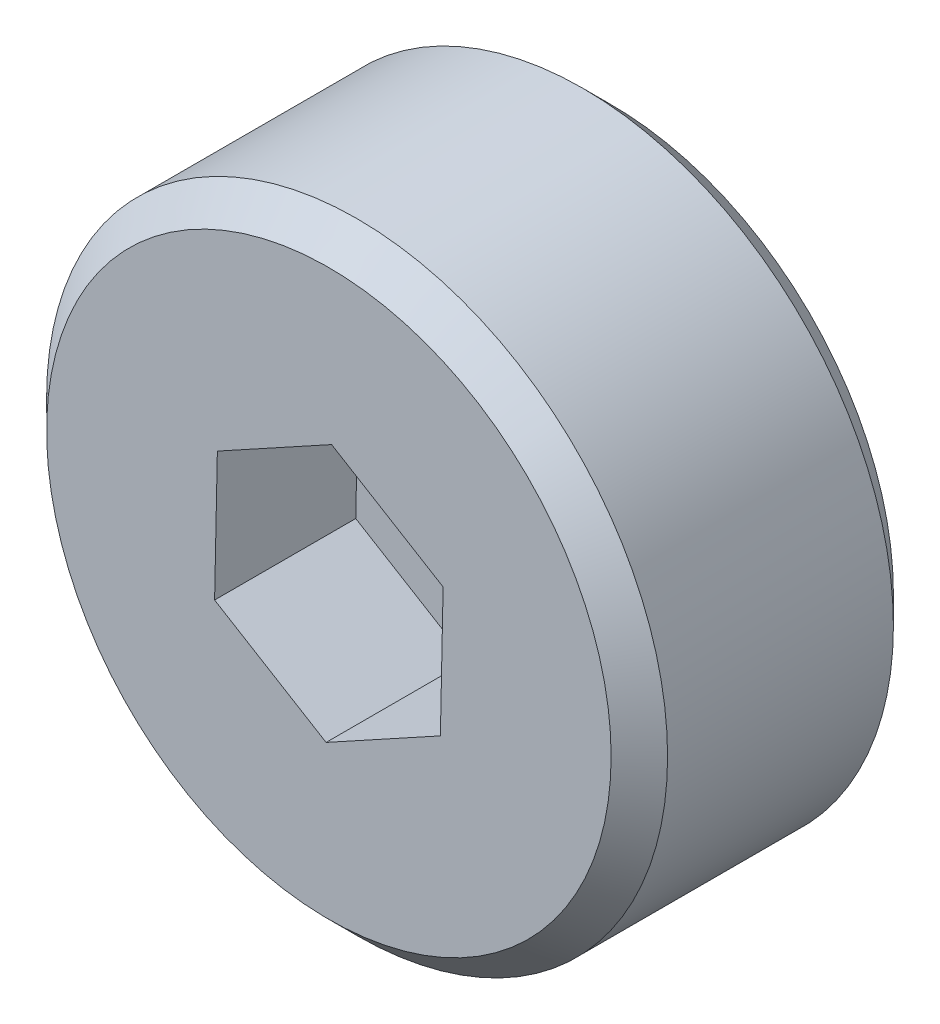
from build123d import *

# Parameters (mm, degrees)
CROQUIS1_R              = 11
SALIENTE_EXTRUIR1_DEPTH = 10
CORTAR_EXTRUIR1_DEPTH   = 5
CHAFL_N1_SIZE           = 1


with BuildPart() as part:
    # Croquis1 → Saliente-Extruir1 (new body)
    with BuildSketch(Plane.XY):
        Circle(CROQUIS1_R)
    extrude(amount=SALIENTE_EXTRUIR1_DEPTH)

    # Croquis2 → Cortar-Extruir1 (cut)
    with BuildSketch(Plane.XY.offset(10)):
        Polygon((-3.950348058, 2.393341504), (-4.047868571, -2.22443102), (-0.097520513, -4.617772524), (3.950348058, -2.393341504), (4.047868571, 2.22443102), (0.097520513, 4.617772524), align=None)
    extrude(amount=-CORTAR_EXTRUIR1_DEPTH, mode=Mode.SUBTRACT)

    # Chafl_n1
    chafl_n1_edges = [part.edges().sort_by_distance(p)[0] for p in [
        (-11, 0, 0),
        (-11, 0, 10),
    ]]
    chamfer(chafl_n1_edges, length=CHAFL_N1_SIZE)


solid = part.part
